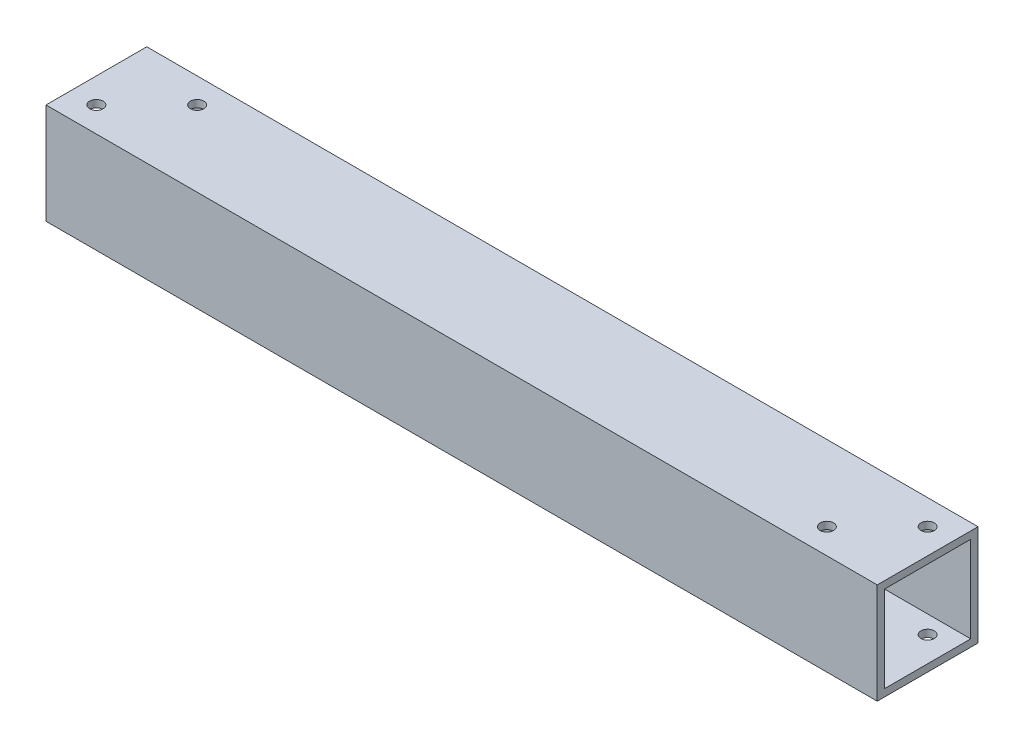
ISO-10303-21;
HEADER;
FILE_DESCRIPTION(('STEP AP214'),'2;1');
FILE_NAME('part.step','',(''),(''),'','','');
FILE_SCHEMA(('AUTOMOTIVE_DESIGN { 1 0 10303 214 1 1 1 1 }'));
ENDSEC;
DATA;
#1=APPLICATION_CONTEXT('core data for automotive mechanical design processes');
#2=APPLICATION_PROTOCOL_DEFINITION('international standard','automotive_design',2000,#1);
#3=PRODUCT_CONTEXT('',#1,'mechanical');
#4=PRODUCT('Part','Part','',(#3));
#5=PRODUCT_RELATED_PRODUCT_CATEGORY('part','',(#4));
#6=PRODUCT_DEFINITION_FORMATION('','',#4);
#7=PRODUCT_DEFINITION_CONTEXT('part definition',#1,'design');
#8=PRODUCT_DEFINITION('design','',#6,#7);
#9=PRODUCT_DEFINITION_SHAPE('','',#8);
#10=(LENGTH_UNIT() NAMED_UNIT(*) SI_UNIT(.MILLI.,.METRE.));
#11=(NAMED_UNIT(*) PLANE_ANGLE_UNIT() SI_UNIT($,.RADIAN.));
#12=(NAMED_UNIT(*) SI_UNIT($,.STERADIAN.) SOLID_ANGLE_UNIT());
#13=UNCERTAINTY_MEASURE_WITH_UNIT(LENGTH_MEASURE(1.E-05),#10,'distance_accuracy_value','');
#14=(GEOMETRIC_REPRESENTATION_CONTEXT(3) GLOBAL_UNCERTAINTY_ASSIGNED_CONTEXT((#13)) GLOBAL_UNIT_ASSIGNED_CONTEXT((#10,
#11,#12)) REPRESENTATION_CONTEXT('',''));
#15=CARTESIAN_POINT('',(0.,0.,0.));
#16=DIRECTION('',(0.,0.,1.));
#17=DIRECTION('',(1.,0.,0.));
#18=AXIS2_PLACEMENT_3D('',#15,#16,#17);
#19=CARTESIAN_POINT('',(419.1,50.8,0.));
#20=DIRECTION('',(-1.,0.,0.));
#21=DIRECTION('',(0.,0.,1.));
#22=AXIS2_PLACEMENT_3D('',#19,#20,#21);
#23=PLANE('',#22);
#24=DIRECTION('',(0.,-1.,0.));
#25=VECTOR('',#24,1.);
#26=CARTESIAN_POINT('',(419.1,0.,0.));
#27=LINE('',#26,#25);
#28=CARTESIAN_POINT('',(419.1,50.8,0.));
#29=VERTEX_POINT('',#28);
#30=CARTESIAN_POINT('',(419.1,0.,0.));
#31=VERTEX_POINT('',#30);
#32=EDGE_CURVE('E135',#29,#31,#27,.T.);
#33=ORIENTED_EDGE('',*,*,#32,.T.);
#34=DIRECTION('',(0.,0.,-1.));
#35=VECTOR('',#34,1.);
#36=CARTESIAN_POINT('',(419.1,0.,0.));
#37=LINE('',#36,#35);
#38=CARTESIAN_POINT('',(419.1,0.,-50.8));
#39=VERTEX_POINT('',#38);
#40=EDGE_CURVE('E138',#31,#39,#37,.T.);
#41=ORIENTED_EDGE('',*,*,#40,.T.);
#42=DIRECTION('',(0.,1.,0.));
#43=VECTOR('',#42,1.);
#44=CARTESIAN_POINT('',(419.1,0.,-50.8));
#45=LINE('',#44,#43);
#46=CARTESIAN_POINT('',(419.1,50.8,-50.8));
#47=VERTEX_POINT('',#46);
#48=EDGE_CURVE('E141',#39,#47,#45,.T.);
#49=ORIENTED_EDGE('',*,*,#48,.T.);
#50=DIRECTION('',(0.,0.,1.));
#51=VECTOR('',#50,1.);
#52=CARTESIAN_POINT('',(419.1,50.8,0.));
#53=LINE('',#52,#51);
#54=EDGE_CURVE('E143',#47,#29,#53,.T.);
#55=ORIENTED_EDGE('',*,*,#54,.T.);
#56=EDGE_LOOP('',(#33,#41,#49,#55));
#57=FACE_BOUND('',#56,.T.);
#58=DIRECTION('',(0.,-1.,0.));
#59=VECTOR('',#58,1.);
#60=CARTESIAN_POINT('',(419.1,47.1424,-3.6576));
#61=LINE('',#60,#59);
#62=CARTESIAN_POINT('',(419.1,47.1424,-3.6576));
#63=VERTEX_POINT('',#62);
#64=CARTESIAN_POINT('',(419.1,3.6576,-3.6576));
#65=VERTEX_POINT('',#64);
#66=EDGE_CURVE('E97',#63,#65,#61,.T.);
#67=ORIENTED_EDGE('',*,*,#66,.F.);
#68=DIRECTION('',(0.,0.,1.));
#69=VECTOR('',#68,1.);
#70=CARTESIAN_POINT('',(419.1,47.1424,-3.6576));
#71=LINE('',#70,#69);
#72=CARTESIAN_POINT('',(419.1,47.1424,-47.1424));
#73=VERTEX_POINT('',#72);
#74=EDGE_CURVE('E119',#73,#63,#71,.T.);
#75=ORIENTED_EDGE('',*,*,#74,.F.);
#76=DIRECTION('',(0.,1.,0.));
#77=VECTOR('',#76,1.);
#78=CARTESIAN_POINT('',(419.1,47.1424,-47.1424));
#79=LINE('',#78,#77);
#80=CARTESIAN_POINT('',(419.1,3.6576,-47.1424));
#81=VERTEX_POINT('',#80);
#82=EDGE_CURVE('E117',#81,#73,#79,.T.);
#83=ORIENTED_EDGE('',*,*,#82,.F.);
#84=DIRECTION('',(0.,0.,-1.));
#85=VECTOR('',#84,1.);
#86=CARTESIAN_POINT('',(419.1,3.6576,-3.6576));
#87=LINE('',#86,#85);
#88=EDGE_CURVE('E105',#65,#81,#87,.T.);
#89=ORIENTED_EDGE('',*,*,#88,.F.);
#90=EDGE_LOOP('',(#67,#75,#83,#89));
#91=FACE_BOUND('',#90,.T.);
#92=ADVANCED_FACE('F30',(#57,#91),#23,.F.);
#93=CARTESIAN_POINT('',(0.,50.8,0.));
#94=DIRECTION('',(-1.,0.,0.));
#95=DIRECTION('',(0.,0.,1.));
#96=AXIS2_PLACEMENT_3D('',#93,#94,#95);
#97=PLANE('',#96);
#98=DIRECTION('',(0.,-1.,0.));
#99=VECTOR('',#98,1.);
#100=CARTESIAN_POINT('',(0.,0.,0.));
#101=LINE('',#100,#99);
#102=CARTESIAN_POINT('',(0.,50.8,0.));
#103=VERTEX_POINT('',#102);
#104=CARTESIAN_POINT('',(0.,0.,0.));
#105=VERTEX_POINT('',#104);
#106=EDGE_CURVE('E113',#103,#105,#101,.T.);
#107=ORIENTED_EDGE('',*,*,#106,.F.);
#108=DIRECTION('',(0.,0.,1.));
#109=VECTOR('',#108,1.);
#110=CARTESIAN_POINT('',(0.,50.8,0.));
#111=LINE('',#110,#109);
#112=CARTESIAN_POINT('',(0.,50.8,-50.8));
#113=VERTEX_POINT('',#112);
#114=EDGE_CURVE('E139',#113,#103,#111,.T.);
#115=ORIENTED_EDGE('',*,*,#114,.F.);
#116=DIRECTION('',(0.,1.,0.));
#117=VECTOR('',#116,1.);
#118=CARTESIAN_POINT('',(0.,0.,-50.8));
#119=LINE('',#118,#117);
#120=CARTESIAN_POINT('',(0.,0.,-50.8));
#121=VERTEX_POINT('',#120);
#122=EDGE_CURVE('E150',#121,#113,#119,.T.);
#123=ORIENTED_EDGE('',*,*,#122,.F.);
#124=DIRECTION('',(0.,0.,-1.));
#125=VECTOR('',#124,1.);
#126=CARTESIAN_POINT('',(0.,0.,0.));
#127=LINE('',#126,#125);
#128=EDGE_CURVE('E148',#105,#121,#127,.T.);
#129=ORIENTED_EDGE('',*,*,#128,.F.);
#130=EDGE_LOOP('',(#107,#115,#123,#129));
#131=FACE_BOUND('',#130,.T.);
#132=DIRECTION('',(0.,0.,1.));
#133=VECTOR('',#132,1.);
#134=CARTESIAN_POINT('',(0.,47.1424,-3.6576));
#135=LINE('',#134,#133);
#136=CARTESIAN_POINT('',(0.,47.1424,-47.1424));
#137=VERTEX_POINT('',#136);
#138=CARTESIAN_POINT('',(0.,47.1424,-3.6576));
#139=VERTEX_POINT('',#138);
#140=EDGE_CURVE('E106',#137,#139,#135,.T.);
#141=ORIENTED_EDGE('',*,*,#140,.T.);
#142=DIRECTION('',(0.,-1.,0.));
#143=VECTOR('',#142,1.);
#144=CARTESIAN_POINT('',(0.,47.1424,-3.6576));
#145=LINE('',#144,#143);
#146=CARTESIAN_POINT('',(0.,3.6576,-3.6576));
#147=VERTEX_POINT('',#146);
#148=EDGE_CURVE('E55',#139,#147,#145,.T.);
#149=ORIENTED_EDGE('',*,*,#148,.T.);
#150=DIRECTION('',(0.,0.,-1.));
#151=VECTOR('',#150,1.);
#152=CARTESIAN_POINT('',(0.,3.6576,-3.6576));
#153=LINE('',#152,#151);
#154=CARTESIAN_POINT('',(0.,3.6576,-47.1424));
#155=VERTEX_POINT('',#154);
#156=EDGE_CURVE('E112',#147,#155,#153,.T.);
#157=ORIENTED_EDGE('',*,*,#156,.T.);
#158=DIRECTION('',(0.,1.,0.));
#159=VECTOR('',#158,1.);
#160=CARTESIAN_POINT('',(0.,47.1424,-47.1424));
#161=LINE('',#160,#159);
#162=EDGE_CURVE('E127',#155,#137,#161,.T.);
#163=ORIENTED_EDGE('',*,*,#162,.T.);
#164=EDGE_LOOP('',(#141,#149,#157,#163));
#165=FACE_BOUND('',#164,.T.);
#166=ADVANCED_FACE('F220',(#131,#165),#97,.T.);
#167=CARTESIAN_POINT('',(419.1,0.,0.));
#168=DIRECTION('',(0.,0.,-1.));
#169=DIRECTION('',(-1.,0.,0.));
#170=AXIS2_PLACEMENT_3D('',#167,#168,#169);
#171=PLANE('',#170);
#172=ORIENTED_EDGE('',*,*,#106,.T.);
#173=DIRECTION('',(-1.,0.,0.));
#174=VECTOR('',#173,1.);
#175=CARTESIAN_POINT('',(419.1,0.,0.));
#176=LINE('',#175,#174);
#177=EDGE_CURVE('E11',#31,#105,#176,.T.);
#178=ORIENTED_EDGE('',*,*,#177,.F.);
#179=ORIENTED_EDGE('',*,*,#32,.F.);
#180=DIRECTION('',(-1.,0.,0.));
#181=VECTOR('',#180,1.);
#182=CARTESIAN_POINT('',(419.1,50.8,0.));
#183=LINE('',#182,#181);
#184=EDGE_CURVE('E145',#29,#103,#183,.T.);
#185=ORIENTED_EDGE('',*,*,#184,.T.);
#186=EDGE_LOOP('',(#172,#178,#179,#185));
#187=FACE_BOUND('',#186,.T.);
#188=ADVANCED_FACE('F32',(#187),#171,.F.);
#189=CARTESIAN_POINT('',(419.1,0.,0.));
#190=DIRECTION('',(0.,1.,0.));
#191=DIRECTION('',(0.,0.,1.));
#192=AXIS2_PLACEMENT_3D('',#189,#190,#191);
#193=PLANE('',#192);
#194=CARTESIAN_POINT('',(381.,0.,-12.7));
#195=DIRECTION('',(0.,1.,0.));
#196=DIRECTION('',(0.,0.,1.));
#197=AXIS2_PLACEMENT_3D('',#194,#195,#196);
#198=CIRCLE('',#197,3.37312000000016);
#199=CARTESIAN_POINT('',(381.,0.,-9.32687999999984));
#200=VERTEX_POINT('',#199);
#201=EDGE_CURVE('E244',#200,#200,#198,.T.);
#202=ORIENTED_EDGE('',*,*,#201,.T.);
#203=EDGE_LOOP('',(#202));
#204=FACE_BOUND('',#203,.T.);
#205=CARTESIAN_POINT('',(406.4,0.,-38.1));
#206=DIRECTION('',(0.,1.,0.));
#207=DIRECTION('',(0.,0.,1.));
#208=AXIS2_PLACEMENT_3D('',#205,#206,#207);
#209=CIRCLE('',#208,3.37312000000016);
#210=CARTESIAN_POINT('',(406.4,0.,-34.7268799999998));
#211=VERTEX_POINT('',#210);
#212=EDGE_CURVE('E171',#211,#211,#209,.T.);
#213=ORIENTED_EDGE('',*,*,#212,.T.);
#214=EDGE_LOOP('',(#213));
#215=FACE_BOUND('',#214,.T.);
#216=CARTESIAN_POINT('',(38.1,0.,-38.1));
#217=DIRECTION('',(0.,1.,0.));
#218=DIRECTION('',(0.,0.,1.));
#219=AXIS2_PLACEMENT_3D('',#216,#217,#218);
#220=CIRCLE('',#219,3.37312);
#221=CARTESIAN_POINT('',(38.1,0.,-34.72688));
#222=VERTEX_POINT('',#221);
#223=EDGE_CURVE('E167',#222,#222,#220,.T.);
#224=ORIENTED_EDGE('',*,*,#223,.T.);
#225=EDGE_LOOP('',(#224));
#226=FACE_BOUND('',#225,.T.);
#227=CARTESIAN_POINT('',(12.7,0.,-12.7));
#228=DIRECTION('',(0.,1.,0.));
#229=DIRECTION('',(0.,0.,1.));
#230=AXIS2_PLACEMENT_3D('',#227,#228,#229);
#231=CIRCLE('',#230,3.37312);
#232=CARTESIAN_POINT('',(12.7,0.,-9.32688));
#233=VERTEX_POINT('',#232);
#234=EDGE_CURVE('E163',#233,#233,#231,.T.);
#235=ORIENTED_EDGE('',*,*,#234,.T.);
#236=EDGE_LOOP('',(#235));
#237=FACE_BOUND('',#236,.T.);
#238=ORIENTED_EDGE('',*,*,#128,.T.);
#239=DIRECTION('',(-1.,0.,0.));
#240=VECTOR('',#239,1.);
#241=CARTESIAN_POINT('',(419.1,0.,-50.8));
#242=LINE('',#241,#240);
#243=EDGE_CURVE('E39',#39,#121,#242,.T.);
#244=ORIENTED_EDGE('',*,*,#243,.F.);
#245=ORIENTED_EDGE('',*,*,#40,.F.);
#246=ORIENTED_EDGE('',*,*,#177,.T.);
#247=EDGE_LOOP('',(#238,#244,#245,#246));
#248=FACE_BOUND('',#247,.T.);
#249=ADVANCED_FACE('F234',(#204,#215,#226,#237,#248),#193,.F.);
#250=CARTESIAN_POINT('',(419.1,0.,-50.8));
#251=DIRECTION('',(0.,0.,1.));
#252=DIRECTION('',(1.,0.,0.));
#253=AXIS2_PLACEMENT_3D('',#250,#251,#252);
#254=PLANE('',#253);
#255=ORIENTED_EDGE('',*,*,#122,.T.);
#256=DIRECTION('',(-1.,0.,0.));
#257=VECTOR('',#256,1.);
#258=CARTESIAN_POINT('',(419.1,50.8,-50.8));
#259=LINE('',#258,#257);
#260=EDGE_CURVE('E155',#47,#113,#259,.T.);
#261=ORIENTED_EDGE('',*,*,#260,.F.);
#262=ORIENTED_EDGE('',*,*,#48,.F.);
#263=ORIENTED_EDGE('',*,*,#243,.T.);
#264=EDGE_LOOP('',(#255,#261,#262,#263));
#265=FACE_BOUND('',#264,.T.);
#266=ADVANCED_FACE('F231',(#265),#254,.F.);
#267=CARTESIAN_POINT('',(419.1,50.8,0.));
#268=DIRECTION('',(0.,-1.,0.));
#269=DIRECTION('',(0.,0.,-1.));
#270=AXIS2_PLACEMENT_3D('',#267,#268,#269);
#271=PLANE('',#270);
#272=CARTESIAN_POINT('',(381.,50.8,-12.7));
#273=DIRECTION('',(0.,1.,0.));
#274=DIRECTION('',(0.,0.,1.));
#275=AXIS2_PLACEMENT_3D('',#272,#273,#274);
#276=CIRCLE('',#275,3.37312000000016);
#277=CARTESIAN_POINT('',(381.,50.8,-9.32687999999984));
#278=VERTEX_POINT('',#277);
#279=EDGE_CURVE('E298',#278,#278,#276,.T.);
#280=ORIENTED_EDGE('',*,*,#279,.F.);
#281=EDGE_LOOP('',(#280));
#282=FACE_BOUND('',#281,.T.);
#283=CARTESIAN_POINT('',(406.4,50.8,-38.1));
#284=DIRECTION('',(0.,1.,0.));
#285=DIRECTION('',(0.,0.,1.));
#286=AXIS2_PLACEMENT_3D('',#283,#284,#285);
#287=CIRCLE('',#286,3.37312000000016);
#288=CARTESIAN_POINT('',(406.4,50.8,-34.7268799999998));
#289=VERTEX_POINT('',#288);
#290=EDGE_CURVE('E178',#289,#289,#287,.T.);
#291=ORIENTED_EDGE('',*,*,#290,.F.);
#292=EDGE_LOOP('',(#291));
#293=FACE_BOUND('',#292,.T.);
#294=CARTESIAN_POINT('',(38.1,50.8,-38.1));
#295=DIRECTION('',(0.,1.,0.));
#296=DIRECTION('',(0.,0.,1.));
#297=AXIS2_PLACEMENT_3D('',#294,#295,#296);
#298=CIRCLE('',#297,3.37312);
#299=CARTESIAN_POINT('',(38.1,50.8,-34.72688));
#300=VERTEX_POINT('',#299);
#301=EDGE_CURVE('E175',#300,#300,#298,.T.);
#302=ORIENTED_EDGE('',*,*,#301,.F.);
#303=EDGE_LOOP('',(#302));
#304=FACE_BOUND('',#303,.T.);
#305=CARTESIAN_POINT('',(12.7,50.8,-12.7));
#306=DIRECTION('',(0.,1.,0.));
#307=DIRECTION('',(0.,0.,1.));
#308=AXIS2_PLACEMENT_3D('',#305,#306,#307);
#309=CIRCLE('',#308,3.37312);
#310=CARTESIAN_POINT('',(12.7,50.8,-9.32688));
#311=VERTEX_POINT('',#310);
#312=EDGE_CURVE('E194',#311,#311,#309,.T.);
#313=ORIENTED_EDGE('',*,*,#312,.F.);
#314=EDGE_LOOP('',(#313));
#315=FACE_BOUND('',#314,.T.);
#316=ORIENTED_EDGE('',*,*,#114,.T.);
#317=ORIENTED_EDGE('',*,*,#184,.F.);
#318=ORIENTED_EDGE('',*,*,#54,.F.);
#319=ORIENTED_EDGE('',*,*,#260,.T.);
#320=EDGE_LOOP('',(#316,#317,#318,#319));
#321=FACE_BOUND('',#320,.T.);
#322=ADVANCED_FACE('F215',(#282,#293,#304,#315,#321),#271,.F.);
#323=CARTESIAN_POINT('',(419.1,47.1424,-3.6576));
#324=DIRECTION('',(0.,0.,-1.));
#325=DIRECTION('',(0.,1.,0.));
#326=AXIS2_PLACEMENT_3D('',#323,#324,#325);
#327=PLANE('',#326);
#328=ORIENTED_EDGE('',*,*,#148,.F.);
#329=DIRECTION('',(-1.,0.,0.));
#330=VECTOR('',#329,1.);
#331=CARTESIAN_POINT('',(419.1,47.1424,-3.6576));
#332=LINE('',#331,#330);
#333=EDGE_CURVE('E101',#63,#139,#332,.T.);
#334=ORIENTED_EDGE('',*,*,#333,.F.);
#335=ORIENTED_EDGE('',*,*,#66,.T.);
#336=DIRECTION('',(-1.,0.,0.));
#337=VECTOR('',#336,1.);
#338=CARTESIAN_POINT('',(419.1,3.6576,-3.6576));
#339=LINE('',#338,#337);
#340=EDGE_CURVE('E100',#65,#147,#339,.T.);
#341=ORIENTED_EDGE('',*,*,#340,.T.);
#342=EDGE_LOOP('',(#328,#334,#335,#341));
#343=FACE_BOUND('',#342,.T.);
#344=ADVANCED_FACE('F99',(#343),#327,.T.);
#345=CARTESIAN_POINT('',(419.1,3.6576,-3.6576));
#346=DIRECTION('',(0.,1.,0.));
#347=DIRECTION('',(0.,0.,1.));
#348=AXIS2_PLACEMENT_3D('',#345,#346,#347);
#349=PLANE('',#348);
#350=CARTESIAN_POINT('',(381.,3.6576,-12.7));
#351=DIRECTION('',(0.,1.,0.));
#352=DIRECTION('',(0.,0.,1.));
#353=AXIS2_PLACEMENT_3D('',#350,#351,#352);
#354=CIRCLE('',#353,3.37312000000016);
#355=CARTESIAN_POINT('',(381.,3.6576,-9.32687999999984));
#356=VERTEX_POINT('',#355);
#357=EDGE_CURVE('E183',#356,#356,#354,.T.);
#358=ORIENTED_EDGE('',*,*,#357,.F.);
#359=EDGE_LOOP('',(#358));
#360=FACE_BOUND('',#359,.T.);
#361=CARTESIAN_POINT('',(406.4,3.6576,-38.1));
#362=DIRECTION('',(0.,1.,0.));
#363=DIRECTION('',(0.,0.,1.));
#364=AXIS2_PLACEMENT_3D('',#361,#362,#363);
#365=CIRCLE('',#364,3.37312000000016);
#366=CARTESIAN_POINT('',(406.4,3.6576,-34.7268799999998));
#367=VERTEX_POINT('',#366);
#368=EDGE_CURVE('E170',#367,#367,#365,.T.);
#369=ORIENTED_EDGE('',*,*,#368,.F.);
#370=EDGE_LOOP('',(#369));
#371=FACE_BOUND('',#370,.T.);
#372=CARTESIAN_POINT('',(38.1,3.6576,-38.1));
#373=DIRECTION('',(0.,1.,0.));
#374=DIRECTION('',(0.,0.,1.));
#375=AXIS2_PLACEMENT_3D('',#372,#373,#374);
#376=CIRCLE('',#375,3.37312);
#377=CARTESIAN_POINT('',(38.1,3.6576,-34.72688));
#378=VERTEX_POINT('',#377);
#379=EDGE_CURVE('E166',#378,#378,#376,.T.);
#380=ORIENTED_EDGE('',*,*,#379,.F.);
#381=EDGE_LOOP('',(#380));
#382=FACE_BOUND('',#381,.T.);
#383=CARTESIAN_POINT('',(12.7,3.6576,-12.7));
#384=DIRECTION('',(0.,1.,0.));
#385=DIRECTION('',(0.,0.,1.));
#386=AXIS2_PLACEMENT_3D('',#383,#384,#385);
#387=CIRCLE('',#386,3.37312);
#388=CARTESIAN_POINT('',(12.7,3.6576,-9.32688));
#389=VERTEX_POINT('',#388);
#390=EDGE_CURVE('E125',#389,#389,#387,.T.);
#391=ORIENTED_EDGE('',*,*,#390,.F.);
#392=EDGE_LOOP('',(#391));
#393=FACE_BOUND('',#392,.T.);
#394=ORIENTED_EDGE('',*,*,#156,.F.);
#395=ORIENTED_EDGE('',*,*,#340,.F.);
#396=ORIENTED_EDGE('',*,*,#88,.T.);
#397=DIRECTION('',(-1.,0.,0.));
#398=VECTOR('',#397,1.);
#399=CARTESIAN_POINT('',(419.1,3.6576,-47.1424));
#400=LINE('',#399,#398);
#401=EDGE_CURVE('E114',#81,#155,#400,.T.);
#402=ORIENTED_EDGE('',*,*,#401,.T.);
#403=EDGE_LOOP('',(#394,#395,#396,#402));
#404=FACE_BOUND('',#403,.T.);
#405=ADVANCED_FACE('F109',(#360,#371,#382,#393,#404),#349,.T.);
#406=CARTESIAN_POINT('',(419.1,47.1424,-47.1424));
#407=DIRECTION('',(0.,0.,1.));
#408=DIRECTION('',(0.,-1.,0.));
#409=AXIS2_PLACEMENT_3D('',#406,#407,#408);
#410=PLANE('',#409);
#411=ORIENTED_EDGE('',*,*,#162,.F.);
#412=ORIENTED_EDGE('',*,*,#401,.F.);
#413=ORIENTED_EDGE('',*,*,#82,.T.);
#414=DIRECTION('',(-1.,0.,0.));
#415=VECTOR('',#414,1.);
#416=CARTESIAN_POINT('',(419.1,47.1424,-47.1424));
#417=LINE('',#416,#415);
#418=EDGE_CURVE('E47',#73,#137,#417,.T.);
#419=ORIENTED_EDGE('',*,*,#418,.T.);
#420=EDGE_LOOP('',(#411,#412,#413,#419));
#421=FACE_BOUND('',#420,.T.);
#422=ADVANCED_FACE('F205',(#421),#410,.T.);
#423=CARTESIAN_POINT('',(419.1,47.1424,-3.6576));
#424=DIRECTION('',(0.,-1.,0.));
#425=DIRECTION('',(0.,0.,-1.));
#426=AXIS2_PLACEMENT_3D('',#423,#424,#425);
#427=PLANE('',#426);
#428=CARTESIAN_POINT('',(381.,47.1424,-12.7));
#429=DIRECTION('',(0.,-1.,0.));
#430=DIRECTION('',(0.,0.,-1.));
#431=AXIS2_PLACEMENT_3D('',#428,#429,#430);
#432=CIRCLE('',#431,3.37312000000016);
#433=CARTESIAN_POINT('',(381.,47.1424,-16.0731200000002));
#434=VERTEX_POINT('',#433);
#435=EDGE_CURVE('E34',#434,#434,#432,.T.);
#436=ORIENTED_EDGE('',*,*,#435,.F.);
#437=EDGE_LOOP('',(#436));
#438=FACE_BOUND('',#437,.T.);
#439=CARTESIAN_POINT('',(406.4,47.1424,-38.1));
#440=DIRECTION('',(0.,-1.,0.));
#441=DIRECTION('',(0.,0.,-1.));
#442=AXIS2_PLACEMENT_3D('',#439,#440,#441);
#443=CIRCLE('',#442,3.37312000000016);
#444=CARTESIAN_POINT('',(406.4,47.1424,-41.4731200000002));
#445=VERTEX_POINT('',#444);
#446=EDGE_CURVE('E168',#445,#445,#443,.T.);
#447=ORIENTED_EDGE('',*,*,#446,.F.);
#448=EDGE_LOOP('',(#447));
#449=FACE_BOUND('',#448,.T.);
#450=CARTESIAN_POINT('',(38.1,47.1424,-38.1));
#451=DIRECTION('',(0.,-1.,0.));
#452=DIRECTION('',(0.,0.,-1.));
#453=AXIS2_PLACEMENT_3D('',#450,#451,#452);
#454=CIRCLE('',#453,3.37312);
#455=CARTESIAN_POINT('',(38.1,47.1424,-41.47312));
#456=VERTEX_POINT('',#455);
#457=EDGE_CURVE('E164',#456,#456,#454,.T.);
#458=ORIENTED_EDGE('',*,*,#457,.F.);
#459=EDGE_LOOP('',(#458));
#460=FACE_BOUND('',#459,.T.);
#461=CARTESIAN_POINT('',(12.7,47.1424,-12.7));
#462=DIRECTION('',(0.,-1.,0.));
#463=DIRECTION('',(0.,0.,-1.));
#464=AXIS2_PLACEMENT_3D('',#461,#462,#463);
#465=CIRCLE('',#464,3.37312);
#466=CARTESIAN_POINT('',(12.7,47.1424,-16.07312));
#467=VERTEX_POINT('',#466);
#468=EDGE_CURVE('E160',#467,#467,#465,.T.);
#469=ORIENTED_EDGE('',*,*,#468,.F.);
#470=EDGE_LOOP('',(#469));
#471=FACE_BOUND('',#470,.T.);
#472=ORIENTED_EDGE('',*,*,#140,.F.);
#473=ORIENTED_EDGE('',*,*,#418,.F.);
#474=ORIENTED_EDGE('',*,*,#74,.T.);
#475=ORIENTED_EDGE('',*,*,#333,.T.);
#476=EDGE_LOOP('',(#472,#473,#474,#475));
#477=FACE_BOUND('',#476,.T.);
#478=ADVANCED_FACE('F212',(#438,#449,#460,#471,#477),#427,.T.);
#479=CARTESIAN_POINT('',(12.7,0.,-12.7));
#480=DIRECTION('',(0.,1.,0.));
#481=DIRECTION('',(0.,0.,1.));
#482=AXIS2_PLACEMENT_3D('',#479,#480,#481);
#483=CYLINDRICAL_SURFACE('',#482,3.37312);
#484=ORIENTED_EDGE('',*,*,#468,.T.);
#485=EDGE_LOOP('',(#484));
#486=FACE_BOUND('',#485,.T.);
#487=ORIENTED_EDGE('',*,*,#312,.T.);
#488=EDGE_LOOP('',(#487));
#489=FACE_BOUND('',#488,.T.);
#490=ADVANCED_FACE('F264',(#486,#489),#483,.F.);
#491=ORIENTED_EDGE('',*,*,#390,.T.);
#492=EDGE_LOOP('',(#491));
#493=FACE_BOUND('',#492,.T.);
#494=ORIENTED_EDGE('',*,*,#234,.F.);
#495=EDGE_LOOP('',(#494));
#496=FACE_BOUND('',#495,.T.);
#497=ADVANCED_FACE('F201',(#493,#496),#483,.F.);
#498=CARTESIAN_POINT('',(38.1,0.,-38.1));
#499=DIRECTION('',(0.,1.,0.));
#500=DIRECTION('',(0.,0.,1.));
#501=AXIS2_PLACEMENT_3D('',#498,#499,#500);
#502=CYLINDRICAL_SURFACE('',#501,3.37312);
#503=ORIENTED_EDGE('',*,*,#457,.T.);
#504=EDGE_LOOP('',(#503));
#505=FACE_BOUND('',#504,.T.);
#506=ORIENTED_EDGE('',*,*,#301,.T.);
#507=EDGE_LOOP('',(#506));
#508=FACE_BOUND('',#507,.T.);
#509=ADVANCED_FACE('F275',(#505,#508),#502,.F.);
#510=ORIENTED_EDGE('',*,*,#379,.T.);
#511=EDGE_LOOP('',(#510));
#512=FACE_BOUND('',#511,.T.);
#513=ORIENTED_EDGE('',*,*,#223,.F.);
#514=EDGE_LOOP('',(#513));
#515=FACE_BOUND('',#514,.T.);
#516=ADVANCED_FACE('F278',(#512,#515),#502,.F.);
#517=CARTESIAN_POINT('',(406.4,0.,-38.1));
#518=DIRECTION('',(0.,1.,0.));
#519=DIRECTION('',(0.,0.,1.));
#520=AXIS2_PLACEMENT_3D('',#517,#518,#519);
#521=CYLINDRICAL_SURFACE('',#520,3.37312000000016);
#522=ORIENTED_EDGE('',*,*,#446,.T.);
#523=EDGE_LOOP('',(#522));
#524=FACE_BOUND('',#523,.T.);
#525=ORIENTED_EDGE('',*,*,#290,.T.);
#526=EDGE_LOOP('',(#525));
#527=FACE_BOUND('',#526,.T.);
#528=ADVANCED_FACE('F280',(#524,#527),#521,.F.);
#529=ORIENTED_EDGE('',*,*,#368,.T.);
#530=EDGE_LOOP('',(#529));
#531=FACE_BOUND('',#530,.T.);
#532=ORIENTED_EDGE('',*,*,#212,.F.);
#533=EDGE_LOOP('',(#532));
#534=FACE_BOUND('',#533,.T.);
#535=ADVANCED_FACE('F283',(#531,#534),#521,.F.);
#536=CARTESIAN_POINT('',(381.,0.,-12.7));
#537=DIRECTION('',(0.,1.,0.));
#538=DIRECTION('',(0.,0.,1.));
#539=AXIS2_PLACEMENT_3D('',#536,#537,#538);
#540=CYLINDRICAL_SURFACE('',#539,3.37312000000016);
#541=ORIENTED_EDGE('',*,*,#435,.T.);
#542=EDGE_LOOP('',(#541));
#543=FACE_BOUND('',#542,.T.);
#544=ORIENTED_EDGE('',*,*,#279,.T.);
#545=EDGE_LOOP('',(#544));
#546=FACE_BOUND('',#545,.T.);
#547=ADVANCED_FACE('F284',(#543,#546),#540,.F.);
#548=ORIENTED_EDGE('',*,*,#357,.T.);
#549=EDGE_LOOP('',(#548));
#550=FACE_BOUND('',#549,.T.);
#551=ORIENTED_EDGE('',*,*,#201,.F.);
#552=EDGE_LOOP('',(#551));
#553=FACE_BOUND('',#552,.T.);
#554=ADVANCED_FACE('F286',(#550,#553),#540,.F.);
#555=CLOSED_SHELL('',(#92,#166,#188,#249,#266,#322,#344,#405,#422,#478,#490,#497,#509,#516,#528,
#535,#547,#554));
#556=MANIFOLD_SOLID_BREP('B2',#555);
#557=ADVANCED_BREP_SHAPE_REPRESENTATION('',(#18,#556),#14);
#558=SHAPE_DEFINITION_REPRESENTATION(#9,#557);
ENDSEC;
END-ISO-10303-21;
